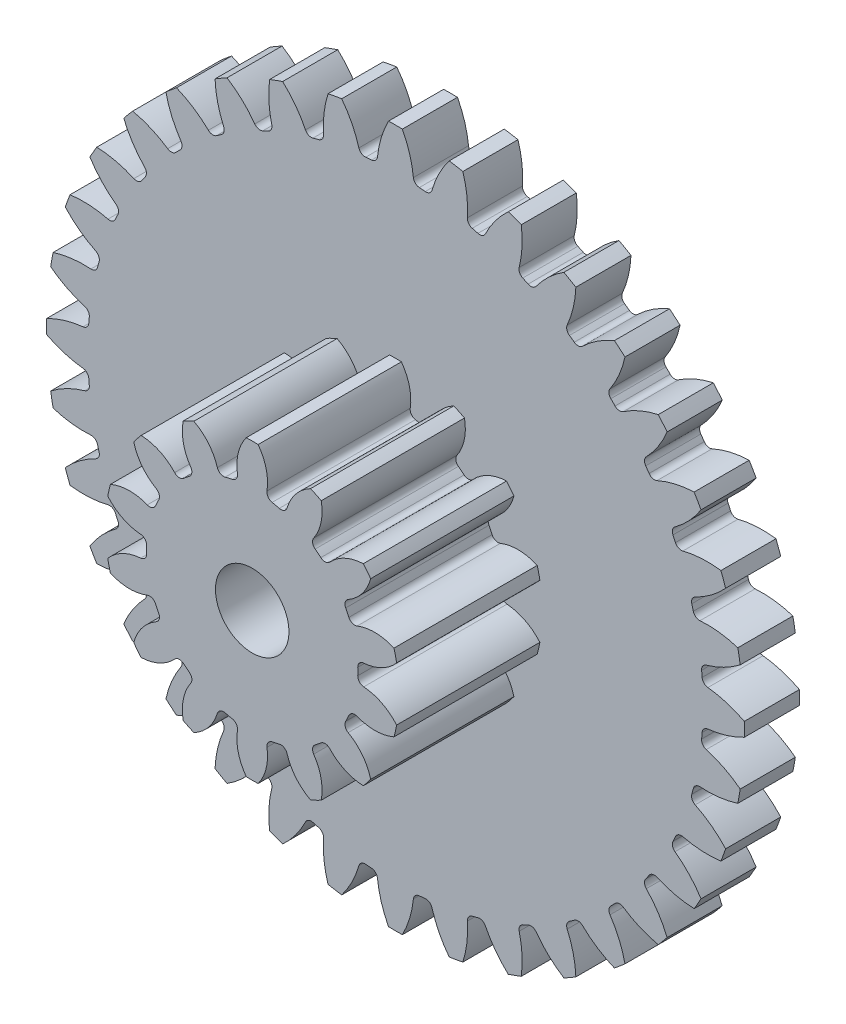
from build123d import *

# Parameters (mm, degrees)
BOSS_EXTRU_1_DEPTH                 = 1.5
CONG_1_R                           = 0.175
R_P_TITION_CIRCULAIRE4_COUNT       = 36
CONG_1_OF_R_P_TITION_CIRCULAIRE4_R = 0.175
BOSS_EXTRU_2_DEPTH                 = 3.9
CONG_2_R                           = 0.175
R_P_TITION_CIRCULAIRE5_COUNT       = 14
CONG_2_OF_R_P_TITION_CIRCULAIRE5_R = 0.175
ESQUISSE10_R                       = 1
ENL_V_MAT_EXTRU_4_DEPTH            = 16.770762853
EXTRUSION1_START                   = 0.5
ESQUISSE11_R                       = 2.2
ESQUISSE11_R_2                     = 1
EXTRUSION1_DEPTH                   = 0.5


with BuildPart() as part:
    # Esquisse3 → Boss.-Extru.1 (new body)
    with BuildSketch(Plane.XY):
        with BuildLine():
            Line((-2.108636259, 7.782778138), (-1.378706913, -0.560352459))
            Line((-1.378706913, -0.560352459), (-0.648777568, 7.782778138))
            ThreePointArc((-0.648777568, 7.782778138), (-0.76345333, 7.792017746), (-0.878245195, 7.799681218))
            ThreePointArc((-0.878245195, 7.799681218), (-0.97321156, 8.385519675), (-1.190535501, 8.937783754))
            ThreePointArc((-1.190535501, 8.937783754), (-1.378706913, 8.939647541), (-1.566878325, 8.937783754))
            ThreePointArc((-1.566878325, 8.937783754), (-1.784202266, 8.385519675), (-1.879168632, 7.799681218))
            ThreePointArc((-1.879168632, 7.799681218), (-1.993960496, 7.792017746), (-2.108636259, 7.782778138))
        make_face()
    boss_extru_1 = extrude(amount=BOSS_EXTRU_1_DEPTH)

    # Cong_1
    cong_1_edges = [part.edges().sort_by_distance(p)[0] for p in [
        (-1.879168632, 7.799681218, 0.75),
        (-0.878245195, 7.799681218, 0.75),
    ]]
    fillet(cong_1_edges, radius=CONG_1_R)

    # R_p_tition circulaire4: Boss.-Extru.1 ×36 about axis
    r_p_tition_circulaire4_axis = Axis((-1.378706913, -0.560352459, 0), (0, 0, 1))
    for i in range(1, R_P_TITION_CIRCULAIRE4_COUNT):
        add(boss_extru_1.rotate(r_p_tition_circulaire4_axis, i * 360 / R_P_TITION_CIRCULAIRE4_COUNT))

    # Cong_1 of R_p_tition circulaire4
    cong_1_of_r_p_tition_circulaire4_edges = [part.edges().sort_by_distance(p)[0] for p in [
        (-3.323270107, 7.585769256, 0.75),
        (-2.337552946, 7.759577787, 0.75),
        (-4.708287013, 7.124341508, 0.75),
        (-3.767726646, 7.466677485, 0.75),
        (-5.992136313, 6.429418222, 0.75),
        (-5.12531119, 6.929879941, 0.75),
        (-7.135808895, 5.522114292, 0.75),
        (-6.369057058, 6.165495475, 0.75),
        (-8.104554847, 4.429997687, 0.75),
        (-7.461173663, 5.196749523, 0.75),
        (-8.868939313, 3.186251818, 0.75),
        (-8.368477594, 4.053076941, 0.75),
        (-9.405736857, 1.828667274, 0.75),
        (-9.06340088, 2.769227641, 0.75),
        (-9.698637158, 0.398493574, 0.75),
        (-9.524828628, 1.384210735, 0.75),
        (-9.738740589, -1.060814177, 0.75),
        (-9.738740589, -0.05989074, 0.75),
        (-9.524828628, -2.504915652, 0.75),
        (-9.698637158, -1.519198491, 0.75),
        (-9.06340088, -3.889932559, 0.75),
        (-9.405736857, -2.949372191, 0.75),
        (-8.368477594, -5.173781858, 0.75),
        (-8.868939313, -4.306956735, 0.75),
        (-7.461173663, -6.317454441, 0.75),
        (-8.104554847, -5.550702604, 0.75),
        (-6.369057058, -7.286200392, 0.75),
        (-7.135808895, -6.642819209, 0.75),
        (-5.12531119, -8.050584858, 0.75),
        (-5.992136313, -7.55012314, 0.75),
        (-3.767726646, -8.587382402, 0.75),
        (-4.708287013, -8.245046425, 0.75),
        (-2.337552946, -8.880282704, 0.75),
        (-3.323270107, -8.706474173, 0.75),
        (-0.878245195, -8.920386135, 0.75),
        (-1.879168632, -8.920386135, 0.75),
        (0.56585628, -8.706474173, 0.75),
        (-0.41986088, -8.880282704, 0.75),
        (1.950873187, -8.245046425, 0.75),
        (1.010312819, -8.587382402, 0.75),
        (3.234722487, -7.55012314, 0.75),
        (2.367897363, -8.050584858, 0.75),
        (4.378395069, -6.642819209, 0.75),
        (3.611643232, -7.286200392, 0.75),
        (5.347141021, -5.550702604, 0.75),
        (4.703759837, -6.317454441, 0.75),
        (6.111525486, -4.306956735, 0.75),
        (5.611063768, -5.173781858, 0.75),
        (6.648323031, -2.949372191, 0.75),
        (6.305987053, -3.889932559, 0.75),
        (6.941223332, -1.519198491, 0.75),
        (6.767414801, -2.504915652, 0.75),
        (6.981326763, -0.05989074, 0.75),
        (6.981326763, -1.060814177, 0.75),
        (6.767414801, 1.384210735, 0.75),
        (6.941223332, 0.398493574, 0.75),
        (6.305987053, 2.769227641, 0.75),
        (6.648323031, 1.828667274, 0.75),
        (5.611063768, 4.053076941, 0.75),
        (6.111525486, 3.186251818, 0.75),
        (4.703759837, 5.196749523, 0.75),
        (5.347141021, 4.429997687, 0.75),
        (3.611643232, 6.165495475, 0.75),
        (4.378395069, 5.522114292, 0.75),
        (2.367897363, 6.929879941, 0.75),
        (3.234722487, 6.429418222, 0.75),
        (1.010312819, 7.466677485, 0.75),
        (1.950873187, 7.124341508, 0.75),
        (-0.41986088, 7.759577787, 0.75),
        (0.56585628, 7.585769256, 0.75),
    ]]
    fillet(cong_1_of_r_p_tition_circulaire4_edges, radius=CONG_1_OF_R_P_TITION_CIRCULAIRE4_R)

    # Esquisse8 → Boss.-Extru.2 (add)
    with BuildSketch(Plane.XY.offset(1.5)):
        with BuildLine():
            Line((-2.018454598, 2.242565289), (-1.378706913, -0.560352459))
            Line((-1.378706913, -0.560352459), (-0.738959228, 2.242565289))
            ThreePointArc((-0.738959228, 2.242565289), (-0.875967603, 2.270350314), (-1.014164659, 2.291442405))
            ThreePointArc((-1.014164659, 2.291442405), (-0.981175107, 2.887779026), (-1.217255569, 3.436387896))
            ThreePointArc((-1.217255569, 3.436387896), (-1.378706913, 3.439647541), (-1.540158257, 3.436387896))
            ThreePointArc((-1.540158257, 3.436387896), (-1.776238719, 2.887779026), (-1.743249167, 2.291442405))
            ThreePointArc((-1.743249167, 2.291442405), (-1.881446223, 2.270350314), (-2.018454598, 2.242565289))
        make_face()
    boss_extru_2 = extrude(amount=BOSS_EXTRU_2_DEPTH)

    # Cong_2
    cong_2_edges = [part.edges().sort_by_distance(p)[0] for p in [
        (-1.014164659, 2.291442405, 3.45),
        (-1.743249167, 2.291442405, 3.45),
    ]]
    fillet(cong_2_edges, radius=CONG_2_R)

    # R_p_tition circulaire5: Boss.-Extru.2 ×14 about axis
    r_p_tition_circulaire5_axis = Axis((-1.378706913, -0.560352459, 0), (0, 0, 1))
    for i in range(1, R_P_TITION_CIRCULAIRE5_COUNT):
        add(boss_extru_2.rotate(r_p_tition_circulaire5_axis, i * 360 / R_P_TITION_CIRCULAIRE5_COUNT))

    # Cong_2 of R_p_tition circulaire5
    cong_2_of_r_p_tition_circulaire5_edges = [part.edges().sort_by_distance(p)[0] for p in [
        (-2.28761311, 2.167194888, 3.45),
        (-2.944495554, 1.850856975, 3.45),
        (-3.381041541, 1.502723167, 3.45),
        (-3.835618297, 0.932701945, 3.45),
        (-4.077883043, 0.429634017, 3.45),
        (-4.240119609, -0.281170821, 3.45),
        (-4.240119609, -0.839534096, 3.45),
        (-4.077883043, -1.550338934, 3.45),
        (-3.835618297, -2.053406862, 3.45),
        (-3.381041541, -2.623428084, 3.45),
        (-2.944495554, -2.971561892, 3.45),
        (-2.28761311, -3.287899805, 3.45),
        (-1.743249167, -3.412147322, 3.45),
        (-1.014164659, -3.412147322, 3.45),
        (-0.469800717, -3.287899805, 3.45),
        (0.187081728, -2.971561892, 3.45),
        (0.623627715, -2.623428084, 3.45),
        (1.078204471, -2.053406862, 3.45),
        (1.320469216, -1.550338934, 3.45),
        (1.482705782, -0.839534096, 3.45),
        (1.482705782, -0.281170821, 3.45),
        (1.320469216, 0.429634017, 3.45),
        (1.078204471, 0.932701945, 3.45),
        (0.623627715, 1.502723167, 3.45),
        (0.187081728, 1.850856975, 3.45),
        (-0.469800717, 2.167194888, 3.45),
    ]]
    fillet(cong_2_of_r_p_tition_circulaire5_edges, radius=CONG_2_OF_R_P_TITION_CIRCULAIRE5_R)

    # Esquisse10 → Enl_v. mat.-Extru.4 (cut, through all)
    with BuildSketch(Plane.XY):
        with Locations(Location((-1.378706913, -0.560352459, 0), (0, 0, 180))):
            Circle(ESQUISSE10_R)
    extrude(amount=ENL_V_MAT_EXTRU_4_DEPTH, mode=Mode.SUBTRACT)

    # Esquisse11 → Extrusion1 (add)
    with BuildSketch(Plane(origin=(0, 0, 0), x_dir=(-1, 0, 0), z_dir=(0, 0, -1)).offset(EXTRUSION1_START)):
        with Locations(Location((1.378706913, -0.560352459, 0), (0, 0, 180))):
            Circle(ESQUISSE11_R)
        with Locations((1.378706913, -0.560352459)):
            Circle(ESQUISSE11_R_2, mode=Mode.SUBTRACT)
    extrude(amount=-EXTRUSION1_DEPTH)


solid = part.part
